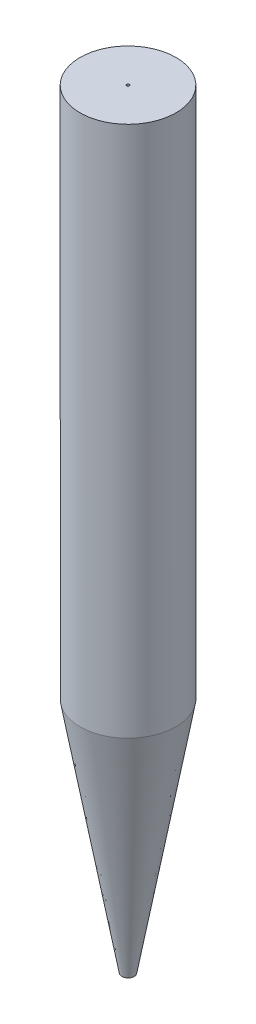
from build123d import *

# Parameters (mm, degrees)
CUT_EXTRUDE1_REACH = 14.749
SKETCH3_R          = 0.02286


with BuildPart() as part:
    # Sketch2 → Revolve1 (revolve)
    with BuildSketch(Plane.XY, mode=Mode.PRIVATE) as revolve1_sk:
        Polygon((0.79248, 3.918175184), (0.1016, 0), (0, 0), (0, 12.7), (0.79248, 12.7), align=None)
    revolve(revolve1_sk.sketch.rotate(Axis((0, 0, 0), (0, 1, 0)), 270), axis=Axis((0, 0, 0), (0, 1, 0)))

    # Sketch3 → Cut-Extrude1 (cut, up to next)
    with BuildSketch(Plane(origin=(0, 12.7, 0), x_dir=(1, 0, 0), z_dir=(0, 1, 0)), mode=Mode.PRIVATE) as cut_extrude1_sk1:
        with Locations(Location((0, 0, 0), (0, 0, 270))):
            Circle(SKETCH3_R)
    cut_extrude1_tool1 = extrude(cut_extrude1_sk1.sketch, amount=-CUT_EXTRUDE1_REACH, mode=Mode.PRIVATE) & part.part
    add(cut_extrude1_tool1.solids().sort_by_distance((0, 12.7, 0))[0], mode=Mode.SUBTRACT)


solid = part.part
